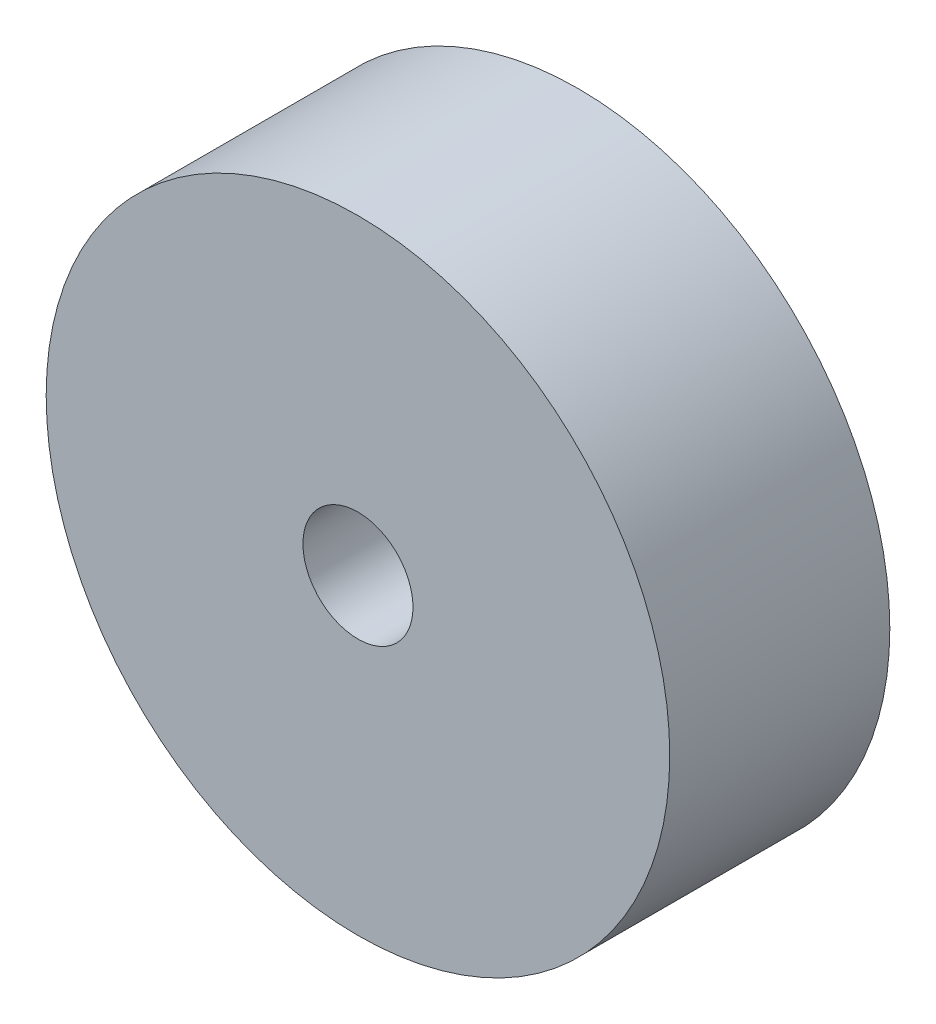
ISO-10303-21;
HEADER;
FILE_DESCRIPTION(('STEP AP214'),'2;1');
FILE_NAME('part.step','',(''),(''),'','','');
FILE_SCHEMA(('AUTOMOTIVE_DESIGN { 1 0 10303 214 1 1 1 1 }'));
ENDSEC;
DATA;
#1=APPLICATION_CONTEXT('core data for automotive mechanical design processes');
#2=APPLICATION_PROTOCOL_DEFINITION('international standard','automotive_design',2000,#1);
#3=PRODUCT_CONTEXT('',#1,'mechanical');
#4=PRODUCT('Part','Part','',(#3));
#5=PRODUCT_RELATED_PRODUCT_CATEGORY('part','',(#4));
#6=PRODUCT_DEFINITION_FORMATION('','',#4);
#7=PRODUCT_DEFINITION_CONTEXT('part definition',#1,'design');
#8=PRODUCT_DEFINITION('design','',#6,#7);
#9=PRODUCT_DEFINITION_SHAPE('','',#8);
#10=(LENGTH_UNIT() NAMED_UNIT(*) SI_UNIT(.MILLI.,.METRE.));
#11=(NAMED_UNIT(*) PLANE_ANGLE_UNIT() SI_UNIT($,.RADIAN.));
#12=(NAMED_UNIT(*) SI_UNIT($,.STERADIAN.) SOLID_ANGLE_UNIT());
#13=UNCERTAINTY_MEASURE_WITH_UNIT(LENGTH_MEASURE(1.E-05),#10,'distance_accuracy_value','');
#14=(GEOMETRIC_REPRESENTATION_CONTEXT(3) GLOBAL_UNCERTAINTY_ASSIGNED_CONTEXT((#13)) GLOBAL_UNIT_ASSIGNED_CONTEXT((#10,
#11,#12)) REPRESENTATION_CONTEXT('',''));
#15=CARTESIAN_POINT('',(0.,0.,0.));
#16=DIRECTION('',(0.,0.,1.));
#17=DIRECTION('',(1.,0.,0.));
#18=AXIS2_PLACEMENT_3D('',#15,#16,#17);
#19=CARTESIAN_POINT('',(0.,0.,12.));
#20=DIRECTION('',(0.,0.,-1.));
#21=DIRECTION('',(-1.,0.,0.));
#22=AXIS2_PLACEMENT_3D('',#19,#20,#21);
#23=CYLINDRICAL_SURFACE('',#22,17.);
#24=CARTESIAN_POINT('',(0.,0.,12.));
#25=DIRECTION('',(0.,0.,1.));
#26=DIRECTION('',(1.,0.,0.));
#27=AXIS2_PLACEMENT_3D('',#24,#25,#26);
#28=CIRCLE('',#27,17.);
#29=CARTESIAN_POINT('',(17.,0.,12.));
#30=VERTEX_POINT('',#29);
#31=EDGE_CURVE('E10',#30,#30,#28,.T.);
#32=ORIENTED_EDGE('',*,*,#31,.F.);
#33=EDGE_LOOP('',(#32));
#34=FACE_BOUND('',#33,.T.);
#35=CARTESIAN_POINT('',(0.,0.,0.));
#36=DIRECTION('',(0.,0.,1.));
#37=DIRECTION('',(1.,0.,0.));
#38=AXIS2_PLACEMENT_3D('',#35,#36,#37);
#39=CIRCLE('',#38,17.);
#40=CARTESIAN_POINT('',(17.,0.,0.));
#41=VERTEX_POINT('',#40);
#42=EDGE_CURVE('E36',#41,#41,#39,.T.);
#43=ORIENTED_EDGE('',*,*,#42,.T.);
#44=EDGE_LOOP('',(#43));
#45=FACE_BOUND('',#44,.T.);
#46=ADVANCED_FACE('F33',(#34,#45),#23,.T.);
#47=CARTESIAN_POINT('',(0.,0.,12.));
#48=DIRECTION('',(0.,0.,1.));
#49=DIRECTION('',(1.,0.,0.));
#50=AXIS2_PLACEMENT_3D('',#47,#48,#49);
#51=PLANE('',#50);
#52=CARTESIAN_POINT('',(0.,0.,12.));
#53=DIRECTION('',(0.,0.,-1.));
#54=DIRECTION('',(-1.,0.,0.));
#55=AXIS2_PLACEMENT_3D('',#52,#53,#54);
#56=CIRCLE('',#55,3.);
#57=CARTESIAN_POINT('',(-3.,0.,12.));
#58=VERTEX_POINT('',#57);
#59=EDGE_CURVE('E43',#58,#58,#56,.T.);
#60=ORIENTED_EDGE('',*,*,#59,.T.);
#61=EDGE_LOOP('',(#60));
#62=FACE_BOUND('',#61,.T.);
#63=ORIENTED_EDGE('',*,*,#31,.T.);
#64=EDGE_LOOP('',(#63));
#65=FACE_BOUND('',#64,.T.);
#66=ADVANCED_FACE('F51',(#62,#65),#51,.T.);
#67=CARTESIAN_POINT('',(0.,0.,0.));
#68=DIRECTION('',(0.,0.,1.));
#69=DIRECTION('',(1.,0.,0.));
#70=AXIS2_PLACEMENT_3D('',#67,#68,#69);
#71=PLANE('',#70);
#72=CARTESIAN_POINT('',(0.,0.,0.));
#73=DIRECTION('',(0.,0.,-1.));
#74=DIRECTION('',(-1.,0.,0.));
#75=AXIS2_PLACEMENT_3D('',#72,#73,#74);
#76=CIRCLE('',#75,3.);
#77=CARTESIAN_POINT('',(-3.,0.,0.));
#78=VERTEX_POINT('',#77);
#79=EDGE_CURVE('E45',#78,#78,#76,.T.);
#80=ORIENTED_EDGE('',*,*,#79,.F.);
#81=EDGE_LOOP('',(#80));
#82=FACE_BOUND('',#81,.T.);
#83=ORIENTED_EDGE('',*,*,#42,.F.);
#84=EDGE_LOOP('',(#83));
#85=FACE_BOUND('',#84,.T.);
#86=ADVANCED_FACE('F56',(#82,#85),#71,.F.);
#87=CARTESIAN_POINT('',(0.,0.,12.));
#88=DIRECTION('',(0.,0.,-1.));
#89=DIRECTION('',(-1.,0.,0.));
#90=AXIS2_PLACEMENT_3D('',#87,#88,#89);
#91=CYLINDRICAL_SURFACE('',#90,3.);
#92=ORIENTED_EDGE('',*,*,#59,.F.);
#93=EDGE_LOOP('',(#92));
#94=FACE_BOUND('',#93,.T.);
#95=ORIENTED_EDGE('',*,*,#79,.T.);
#96=EDGE_LOOP('',(#95));
#97=FACE_BOUND('',#96,.T.);
#98=ADVANCED_FACE('F53',(#94,#97),#91,.F.);
#99=CLOSED_SHELL('',(#46,#66,#86,#98));
#100=MANIFOLD_SOLID_BREP('B2',#99);
#101=ADVANCED_BREP_SHAPE_REPRESENTATION('',(#18,#100),#14);
#102=SHAPE_DEFINITION_REPRESENTATION(#9,#101);
ENDSEC;
END-ISO-10303-21;
